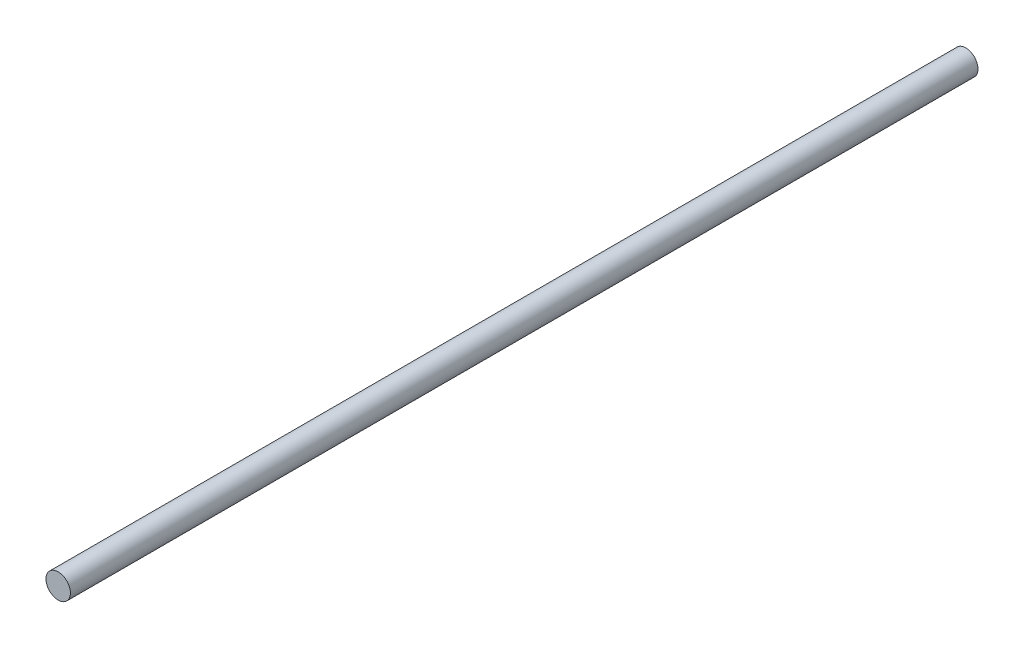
from build123d import *

# Parameters (mm, degrees)
SKETCH1_R           = 4
BOSS_EXTRUDE1_DEPTH = 148.5


with BuildPart() as part:
    # Sketch1 → Boss-Extrude1 (new, symmetric)
    with BuildSketch(Plane.XY):
        Circle(SKETCH1_R)
    extrude(amount=BOSS_EXTRUDE1_DEPTH, both=True)


solid = part.part
